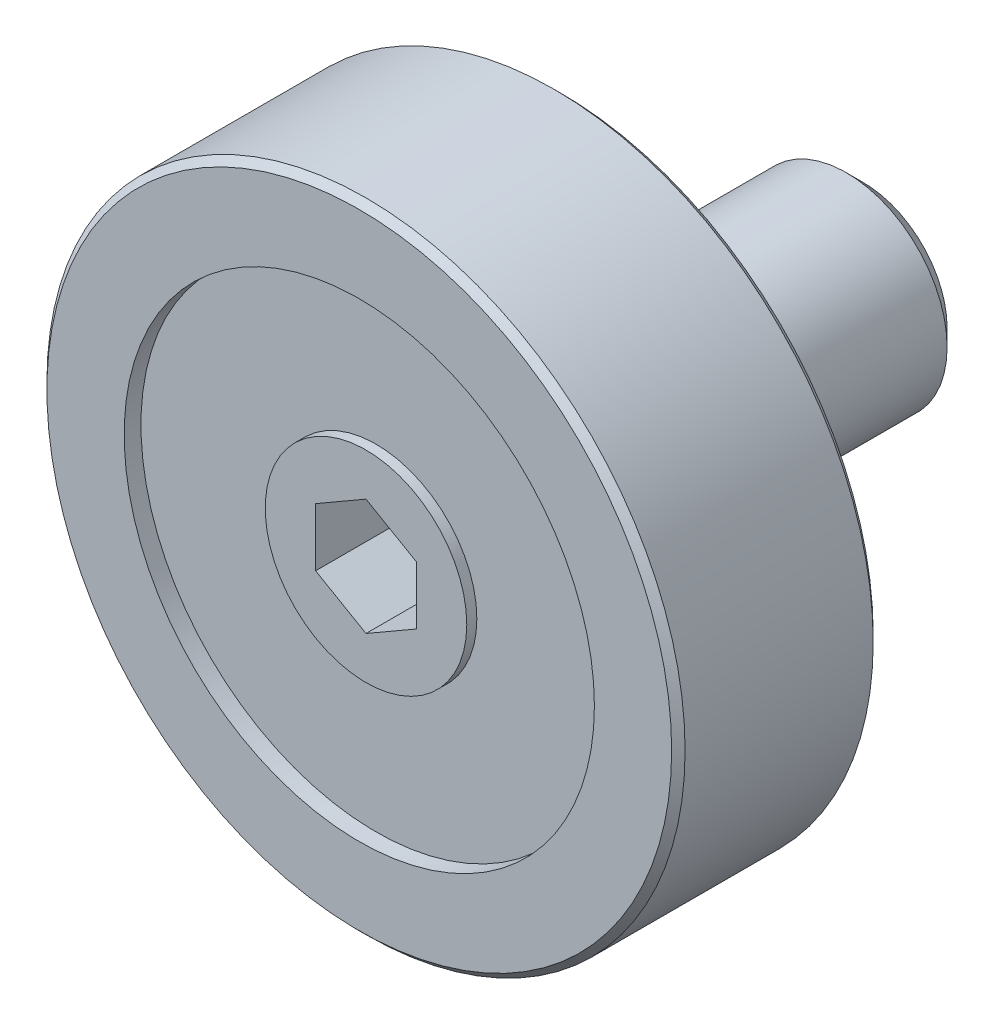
ISO-10303-21;
HEADER;
FILE_DESCRIPTION(('STEP AP214'),'2;1');
FILE_NAME('part.step','',(''),(''),'','','');
FILE_SCHEMA(('AUTOMOTIVE_DESIGN { 1 0 10303 214 1 1 1 1 }'));
ENDSEC;
DATA;
#1=APPLICATION_CONTEXT('core data for automotive mechanical design processes');
#2=APPLICATION_PROTOCOL_DEFINITION('international standard','automotive_design',2000,#1);
#3=PRODUCT_CONTEXT('',#1,'mechanical');
#4=PRODUCT('Part','Part','',(#3));
#5=PRODUCT_RELATED_PRODUCT_CATEGORY('part','',(#4));
#6=PRODUCT_DEFINITION_FORMATION('','',#4);
#7=PRODUCT_DEFINITION_CONTEXT('part definition',#1,'design');
#8=PRODUCT_DEFINITION('design','',#6,#7);
#9=PRODUCT_DEFINITION_SHAPE('','',#8);
#10=(LENGTH_UNIT() NAMED_UNIT(*) SI_UNIT(.MILLI.,.METRE.));
#11=(NAMED_UNIT(*) PLANE_ANGLE_UNIT() SI_UNIT($,.RADIAN.));
#12=(NAMED_UNIT(*) SI_UNIT($,.STERADIAN.) SOLID_ANGLE_UNIT());
#13=UNCERTAINTY_MEASURE_WITH_UNIT(LENGTH_MEASURE(1.E-05),#10,'distance_accuracy_value','');
#14=(GEOMETRIC_REPRESENTATION_CONTEXT(3) GLOBAL_UNCERTAINTY_ASSIGNED_CONTEXT((#13)) GLOBAL_UNIT_ASSIGNED_CONTEXT((#10,
#11,#12)) REPRESENTATION_CONTEXT('',''));
#15=CARTESIAN_POINT('',(0.,0.,0.));
#16=DIRECTION('',(0.,0.,1.));
#17=DIRECTION('',(1.,0.,0.));
#18=AXIS2_PLACEMENT_3D('',#15,#16,#17);
#19=CARTESIAN_POINT('',(0.,8.5,1.));
#20=DIRECTION('',(0.,0.,1.));
#21=DIRECTION('',(1.,0.,0.));
#22=AXIS2_PLACEMENT_3D('',#19,#20,#21);
#23=PLANE('',#22);
#24=CARTESIAN_POINT('',(0.,0.,1.));
#25=DIRECTION('',(0.,0.,1.));
#26=DIRECTION('',(1.,0.,0.));
#27=AXIS2_PLACEMENT_3D('',#24,#25,#26);
#28=CIRCLE('',#27,9.3);
#29=CARTESIAN_POINT('',(9.3,0.,1.));
#30=VERTEX_POINT('',#29);
#31=EDGE_CURVE('E432',#30,#30,#28,.T.);
#32=ORIENTED_EDGE('',*,*,#31,.F.);
#33=EDGE_LOOP('',(#32));
#34=FACE_BOUND('',#33,.T.);
#35=CARTESIAN_POINT('',(0.,0.,1.));
#36=DIRECTION('',(0.,0.,1.));
#37=DIRECTION('',(1.,0.,0.));
#38=AXIS2_PLACEMENT_3D('',#35,#36,#37);
#39=CIRCLE('',#38,7.);
#40=CARTESIAN_POINT('',(7.,0.,1.));
#41=VERTEX_POINT('',#40);
#42=EDGE_CURVE('E134',#41,#41,#39,.T.);
#43=ORIENTED_EDGE('',*,*,#42,.T.);
#44=EDGE_LOOP('',(#43));
#45=FACE_BOUND('',#44,.T.);
#46=ADVANCED_FACE('F14',(#34,#45),#23,.F.);
#47=CARTESIAN_POINT('',(0.,0.,-8.));
#48=DIRECTION('',(0.,0.,1.));
#49=DIRECTION('',(1.,0.,0.));
#50=AXIS2_PLACEMENT_3D('',#47,#48,#49);
#51=PLANE('',#50);
#52=CARTESIAN_POINT('',(0.,0.,-8.));
#53=DIRECTION('',(0.,0.,1.));
#54=DIRECTION('',(1.,0.,0.));
#55=AXIS2_PLACEMENT_3D('',#52,#53,#54);
#56=CIRCLE('',#55,2.49999999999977);
#57=CARTESIAN_POINT('',(2.49999999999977,0.,-8.));
#58=VERTEX_POINT('',#57);
#59=EDGE_CURVE('E9',#58,#58,#56,.T.);
#60=ORIENTED_EDGE('',*,*,#59,.F.);
#61=EDGE_LOOP('',(#60));
#62=FACE_BOUND('',#61,.T.);
#63=ADVANCED_FACE('F16',(#62),#51,.F.);
#64=CARTESIAN_POINT('',(0.,0.,-8.));
#65=DIRECTION('',(0.,0.,1.));
#66=DIRECTION('',(1.,0.,0.));
#67=AXIS2_PLACEMENT_3D('',#64,#65,#66);
#68=CONICAL_SURFACE('',#67,2.49999999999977,0.785398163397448);
#69=CARTESIAN_POINT('',(0.,0.,-7.5));
#70=DIRECTION('',(0.,0.,1.));
#71=DIRECTION('',(1.,0.,0.));
#72=AXIS2_PLACEMENT_3D('',#69,#70,#71);
#73=CIRCLE('',#72,2.99999999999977);
#74=CARTESIAN_POINT('',(2.99999999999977,0.,-7.5));
#75=VERTEX_POINT('',#74);
#76=EDGE_CURVE('E22',#75,#75,#73,.T.);
#77=ORIENTED_EDGE('',*,*,#76,.F.);
#78=EDGE_LOOP('',(#77));
#79=FACE_BOUND('',#78,.T.);
#80=ORIENTED_EDGE('',*,*,#59,.T.);
#81=EDGE_LOOP('',(#80));
#82=FACE_BOUND('',#81,.T.);
#83=ADVANCED_FACE('F159',(#79,#82),#68,.T.);
#84=CARTESIAN_POINT('',(0.,0.,10.));
#85=DIRECTION('',(0.,0.,1.));
#86=DIRECTION('',(1.,0.,0.));
#87=AXIS2_PLACEMENT_3D('',#84,#85,#86);
#88=CYLINDRICAL_SURFACE('',#87,2.99999999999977);
#89=CARTESIAN_POINT('',(0.,0.,-2.));
#90=DIRECTION('',(0.,0.,1.));
#91=DIRECTION('',(1.,0.,0.));
#92=AXIS2_PLACEMENT_3D('',#89,#90,#91);
#93=CIRCLE('',#92,2.99999999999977);
#94=CARTESIAN_POINT('',(2.99999999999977,0.,-2.));
#95=VERTEX_POINT('',#94);
#96=EDGE_CURVE('E152',#95,#95,#93,.T.);
#97=ORIENTED_EDGE('',*,*,#96,.F.);
#98=EDGE_LOOP('',(#97));
#99=FACE_BOUND('',#98,.T.);
#100=ORIENTED_EDGE('',*,*,#76,.T.);
#101=EDGE_LOOP('',(#100));
#102=FACE_BOUND('',#101,.T.);
#103=ADVANCED_FACE('F157',(#99,#102),#88,.T.);
#104=CARTESIAN_POINT('',(0.,2.34999999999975,-2.));
#105=DIRECTION('',(0.,0.,-1.));
#106=DIRECTION('',(-1.,0.,0.));
#107=AXIS2_PLACEMENT_3D('',#104,#105,#106);
#108=PLANE('',#107);
#109=CARTESIAN_POINT('',(0.,0.,-2.));
#110=DIRECTION('',(0.,0.,1.));
#111=DIRECTION('',(1.,0.,0.));
#112=AXIS2_PLACEMENT_3D('',#109,#110,#111);
#113=CIRCLE('',#112,2.34999999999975);
#114=CARTESIAN_POINT('',(2.34999999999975,0.,-2.));
#115=VERTEX_POINT('',#114);
#116=EDGE_CURVE('E149',#115,#115,#113,.T.);
#117=ORIENTED_EDGE('',*,*,#116,.F.);
#118=EDGE_LOOP('',(#117));
#119=FACE_BOUND('',#118,.T.);
#120=ORIENTED_EDGE('',*,*,#96,.T.);
#121=EDGE_LOOP('',(#120));
#122=FACE_BOUND('',#121,.T.);
#123=ADVANCED_FACE('F199',(#119,#122),#108,.F.);
#124=CARTESIAN_POINT('',(0.,0.,10.));
#125=DIRECTION('',(0.,0.,1.));
#126=DIRECTION('',(1.,0.,0.));
#127=AXIS2_PLACEMENT_3D('',#124,#125,#126);
#128=CYLINDRICAL_SURFACE('',#127,2.34999999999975);
#129=CARTESIAN_POINT('',(0.,0.,0.));
#130=DIRECTION('',(0.,0.,1.));
#131=DIRECTION('',(1.,0.,0.));
#132=AXIS2_PLACEMENT_3D('',#129,#130,#131);
#133=CIRCLE('',#132,2.34999999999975);
#134=CARTESIAN_POINT('',(2.34999999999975,0.,0.));
#135=VERTEX_POINT('',#134);
#136=EDGE_CURVE('E146',#135,#135,#133,.T.);
#137=ORIENTED_EDGE('',*,*,#136,.F.);
#138=EDGE_LOOP('',(#137));
#139=FACE_BOUND('',#138,.T.);
#140=ORIENTED_EDGE('',*,*,#116,.T.);
#141=EDGE_LOOP('',(#140));
#142=FACE_BOUND('',#141,.T.);
#143=ADVANCED_FACE('F195',(#139,#142),#128,.T.);
#144=CARTESIAN_POINT('',(0.,3.99999999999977,0.));
#145=DIRECTION('',(0.,0.,1.));
#146=DIRECTION('',(1.,0.,0.));
#147=AXIS2_PLACEMENT_3D('',#144,#145,#146);
#148=PLANE('',#147);
#149=CARTESIAN_POINT('',(0.,0.,0.));
#150=DIRECTION('',(0.,0.,1.));
#151=DIRECTION('',(1.,0.,0.));
#152=AXIS2_PLACEMENT_3D('',#149,#150,#151);
#153=CIRCLE('',#152,3.99999999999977);
#154=CARTESIAN_POINT('',(3.99999999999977,0.,0.));
#155=VERTEX_POINT('',#154);
#156=EDGE_CURVE('E143',#155,#155,#153,.T.);
#157=ORIENTED_EDGE('',*,*,#156,.F.);
#158=EDGE_LOOP('',(#157));
#159=FACE_BOUND('',#158,.T.);
#160=ORIENTED_EDGE('',*,*,#136,.T.);
#161=EDGE_LOOP('',(#160));
#162=FACE_BOUND('',#161,.T.);
#163=ADVANCED_FACE('F191',(#159,#162),#148,.F.);
#164=CARTESIAN_POINT('',(0.,0.,10.));
#165=DIRECTION('',(0.,0.,1.));
#166=DIRECTION('',(1.,0.,0.));
#167=AXIS2_PLACEMENT_3D('',#164,#165,#166);
#168=CYLINDRICAL_SURFACE('',#167,3.99999999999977);
#169=CARTESIAN_POINT('',(0.,0.,1.5));
#170=DIRECTION('',(0.,0.,1.));
#171=DIRECTION('',(1.,0.,0.));
#172=AXIS2_PLACEMENT_3D('',#169,#170,#171);
#173=CIRCLE('',#172,3.99999999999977);
#174=CARTESIAN_POINT('',(3.99999999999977,0.,1.5));
#175=VERTEX_POINT('',#174);
#176=EDGE_CURVE('E140',#175,#175,#173,.T.);
#177=ORIENTED_EDGE('',*,*,#176,.F.);
#178=EDGE_LOOP('',(#177));
#179=FACE_BOUND('',#178,.T.);
#180=ORIENTED_EDGE('',*,*,#156,.T.);
#181=EDGE_LOOP('',(#180));
#182=FACE_BOUND('',#181,.T.);
#183=ADVANCED_FACE('F187',(#179,#182),#168,.T.);
#184=CARTESIAN_POINT('',(0.,3.99999999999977,1.5));
#185=DIRECTION('',(0.,0.,1.));
#186=DIRECTION('',(1.,0.,0.));
#187=AXIS2_PLACEMENT_3D('',#184,#185,#186);
#188=PLANE('',#187);
#189=CARTESIAN_POINT('',(0.,0.,1.5));
#190=DIRECTION('',(0.,0.,1.));
#191=DIRECTION('',(1.,0.,0.));
#192=AXIS2_PLACEMENT_3D('',#189,#190,#191);
#193=CIRCLE('',#192,7.);
#194=CARTESIAN_POINT('',(7.,0.,1.5));
#195=VERTEX_POINT('',#194);
#196=EDGE_CURVE('E137',#195,#195,#193,.T.);
#197=ORIENTED_EDGE('',*,*,#196,.F.);
#198=EDGE_LOOP('',(#197));
#199=FACE_BOUND('',#198,.T.);
#200=ORIENTED_EDGE('',*,*,#176,.T.);
#201=EDGE_LOOP('',(#200));
#202=FACE_BOUND('',#201,.T.);
#203=ADVANCED_FACE('F183',(#199,#202),#188,.F.);
#204=CARTESIAN_POINT('',(0.,0.,10.));
#205=DIRECTION('',(0.,0.,1.));
#206=DIRECTION('',(1.,0.,0.));
#207=AXIS2_PLACEMENT_3D('',#204,#205,#206);
#208=CYLINDRICAL_SURFACE('',#207,7.);
#209=ORIENTED_EDGE('',*,*,#42,.F.);
#210=EDGE_LOOP('',(#209));
#211=FACE_BOUND('',#210,.T.);
#212=ORIENTED_EDGE('',*,*,#196,.T.);
#213=EDGE_LOOP('',(#212));
#214=FACE_BOUND('',#213,.T.);
#215=ADVANCED_FACE('F179',(#211,#214),#208,.F.);
#216=CARTESIAN_POINT('',(0.,0.,6.8));
#217=DIRECTION('',(0.,0.,-1.));
#218=DIRECTION('',(-1.,0.,0.));
#219=AXIS2_PLACEMENT_3D('',#216,#217,#218);
#220=CONICAL_SURFACE('',#219,9.5,0.78539816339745);
#221=CARTESIAN_POINT('',(0.,0.,7.));
#222=DIRECTION('',(0.,0.,1.));
#223=DIRECTION('',(1.,0.,0.));
#224=AXIS2_PLACEMENT_3D('',#221,#222,#223);
#225=CIRCLE('',#224,9.3);
#226=CARTESIAN_POINT('',(9.3,0.,7.));
#227=VERTEX_POINT('',#226);
#228=EDGE_CURVE('E104',#227,#227,#225,.T.);
#229=ORIENTED_EDGE('',*,*,#228,.F.);
#230=EDGE_LOOP('',(#229));
#231=FACE_BOUND('',#230,.T.);
#232=CARTESIAN_POINT('',(0.,0.,6.8));
#233=DIRECTION('',(0.,0.,1.));
#234=DIRECTION('',(1.,0.,0.));
#235=AXIS2_PLACEMENT_3D('',#232,#233,#234);
#236=CIRCLE('',#235,9.5);
#237=CARTESIAN_POINT('',(9.5,0.,6.8));
#238=VERTEX_POINT('',#237);
#239=EDGE_CURVE('E413',#238,#238,#236,.T.);
#240=ORIENTED_EDGE('',*,*,#239,.T.);
#241=EDGE_LOOP('',(#240));
#242=FACE_BOUND('',#241,.T.);
#243=ADVANCED_FACE('F182',(#231,#242),#220,.T.);
#244=CARTESIAN_POINT('',(0.,0.,7.));
#245=DIRECTION('',(0.,0.,1.));
#246=DIRECTION('',(1.,0.,0.));
#247=AXIS2_PLACEMENT_3D('',#244,#245,#246);
#248=CYLINDRICAL_SURFACE('',#247,9.5);
#249=ORIENTED_EDGE('',*,*,#239,.F.);
#250=EDGE_LOOP('',(#249));
#251=FACE_BOUND('',#250,.T.);
#252=CARTESIAN_POINT('',(0.,0.,1.2));
#253=DIRECTION('',(0.,0.,1.));
#254=DIRECTION('',(1.,0.,0.));
#255=AXIS2_PLACEMENT_3D('',#252,#253,#254);
#256=CIRCLE('',#255,9.5);
#257=CARTESIAN_POINT('',(9.5,0.,1.2));
#258=VERTEX_POINT('',#257);
#259=EDGE_CURVE('E416',#258,#258,#256,.T.);
#260=ORIENTED_EDGE('',*,*,#259,.T.);
#261=EDGE_LOOP('',(#260));
#262=FACE_BOUND('',#261,.T.);
#263=ADVANCED_FACE('F251',(#251,#262),#248,.T.);
#264=CARTESIAN_POINT('',(0.,0.,1.));
#265=DIRECTION('',(0.,0.,1.));
#266=DIRECTION('',(1.,0.,0.));
#267=AXIS2_PLACEMENT_3D('',#264,#265,#266);
#268=CONICAL_SURFACE('',#267,9.3,0.78539816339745);
#269=ORIENTED_EDGE('',*,*,#259,.F.);
#270=EDGE_LOOP('',(#269));
#271=FACE_BOUND('',#270,.T.);
#272=ORIENTED_EDGE('',*,*,#31,.T.);
#273=EDGE_LOOP('',(#272));
#274=FACE_BOUND('',#273,.T.);
#275=ADVANCED_FACE('F260',(#271,#274),#268,.T.);
#276=CARTESIAN_POINT('',(0.,0.,4.3));
#277=DIRECTION('',(0.,0.,1.));
#278=DIRECTION('',(1.,0.,0.));
#279=AXIS2_PLACEMENT_3D('',#276,#277,#278);
#280=PLANE('',#279);
#281=DIRECTION('',(-0.866025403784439,0.5,0.));
#282=VECTOR('',#281,1.);
#283=CARTESIAN_POINT('',(1.5,0.86602540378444,4.3));
#284=LINE('',#283,#282);
#285=CARTESIAN_POINT('',(1.5,0.86602540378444,4.3));
#286=VERTEX_POINT('',#285);
#287=CARTESIAN_POINT('',(0.,1.73205080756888,4.3));
#288=VERTEX_POINT('',#287);
#289=EDGE_CURVE('E115',#286,#288,#284,.T.);
#290=ORIENTED_EDGE('',*,*,#289,.T.);
#291=DIRECTION('',(-0.866025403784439,-0.5,0.));
#292=VECTOR('',#291,1.);
#293=CARTESIAN_POINT('',(0.,1.73205080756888,4.3));
#294=LINE('',#293,#292);
#295=CARTESIAN_POINT('',(-1.5,0.866025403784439,4.3));
#296=VERTEX_POINT('',#295);
#297=EDGE_CURVE('E97',#288,#296,#294,.T.);
#298=ORIENTED_EDGE('',*,*,#297,.T.);
#299=DIRECTION('',(0.,-1.,0.));
#300=VECTOR('',#299,1.);
#301=CARTESIAN_POINT('',(-1.5,0.866025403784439,4.3));
#302=LINE('',#301,#300);
#303=CARTESIAN_POINT('',(-1.5,-0.866025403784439,4.3));
#304=VERTEX_POINT('',#303);
#305=EDGE_CURVE('E95',#296,#304,#302,.T.);
#306=ORIENTED_EDGE('',*,*,#305,.T.);
#307=DIRECTION('',(0.866025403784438,-0.5,0.));
#308=VECTOR('',#307,1.);
#309=CARTESIAN_POINT('',(-1.5,-0.866025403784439,4.3));
#310=LINE('',#309,#308);
#311=CARTESIAN_POINT('',(0.,-1.73205080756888,4.3));
#312=VERTEX_POINT('',#311);
#313=EDGE_CURVE('E74',#304,#312,#310,.T.);
#314=ORIENTED_EDGE('',*,*,#313,.T.);
#315=DIRECTION('',(0.866025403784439,0.5,0.));
#316=VECTOR('',#315,1.);
#317=CARTESIAN_POINT('',(0.,-1.73205080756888,4.3));
#318=LINE('',#317,#316);
#319=CARTESIAN_POINT('',(1.5,-0.866025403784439,4.3));
#320=VERTEX_POINT('',#319);
#321=EDGE_CURVE('E85',#312,#320,#318,.T.);
#322=ORIENTED_EDGE('',*,*,#321,.T.);
#323=DIRECTION('',(0.,1.,0.));
#324=VECTOR('',#323,1.);
#325=CARTESIAN_POINT('',(1.5,-0.866025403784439,4.3));
#326=LINE('',#325,#324);
#327=EDGE_CURVE('E89',#320,#286,#326,.T.);
#328=ORIENTED_EDGE('',*,*,#327,.T.);
#329=EDGE_LOOP('',(#290,#298,#306,#314,#322,#328));
#330=FACE_BOUND('',#329,.T.);
#331=ADVANCED_FACE('F92',(#330),#280,.T.);
#332=CARTESIAN_POINT('',(-1.5,0.866025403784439,4.3));
#333=DIRECTION('',(-1.,0.,0.));
#334=DIRECTION('',(0.,-1.,0.));
#335=AXIS2_PLACEMENT_3D('',#332,#333,#334);
#336=PLANE('',#335);
#337=DIRECTION('',(0.,-1.,0.));
#338=VECTOR('',#337,1.);
#339=CARTESIAN_POINT('',(-1.5,0.866025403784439,6.8));
#340=LINE('',#339,#338);
#341=CARTESIAN_POINT('',(-1.5,0.866025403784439,6.8));
#342=VERTEX_POINT('',#341);
#343=CARTESIAN_POINT('',(-1.5,-0.866025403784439,6.8));
#344=VERTEX_POINT('',#343);
#345=EDGE_CURVE('E107',#342,#344,#340,.T.);
#346=ORIENTED_EDGE('',*,*,#345,.T.);
#347=DIRECTION('',(0.,0.,1.));
#348=VECTOR('',#347,1.);
#349=CARTESIAN_POINT('',(-1.5,-0.866025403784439,4.3));
#350=LINE('',#349,#348);
#351=EDGE_CURVE('E82',#304,#344,#350,.T.);
#352=ORIENTED_EDGE('',*,*,#351,.F.);
#353=ORIENTED_EDGE('',*,*,#305,.F.);
#354=DIRECTION('',(0.,0.,1.));
#355=VECTOR('',#354,1.);
#356=CARTESIAN_POINT('',(-1.5,0.866025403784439,4.3));
#357=LINE('',#356,#355);
#358=EDGE_CURVE('E120',#296,#342,#357,.T.);
#359=ORIENTED_EDGE('',*,*,#358,.T.);
#360=EDGE_LOOP('',(#346,#352,#353,#359));
#361=FACE_BOUND('',#360,.T.);
#362=ADVANCED_FACE('F277',(#361),#336,.F.);
#363=CARTESIAN_POINT('',(-1.5,-0.866025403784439,4.3));
#364=DIRECTION('',(-0.5,-0.866025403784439,0.));
#365=DIRECTION('',(0.866025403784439,-0.5,0.));
#366=AXIS2_PLACEMENT_3D('',#363,#364,#365);
#367=PLANE('',#366);
#368=DIRECTION('',(0.866025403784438,-0.5,0.));
#369=VECTOR('',#368,1.);
#370=CARTESIAN_POINT('',(-1.5,-0.866025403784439,6.8));
#371=LINE('',#370,#369);
#372=CARTESIAN_POINT('',(0.,-1.73205080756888,6.8));
#373=VERTEX_POINT('',#372);
#374=EDGE_CURVE('E77',#344,#373,#371,.T.);
#375=ORIENTED_EDGE('',*,*,#374,.T.);
#376=DIRECTION('',(0.,0.,1.));
#377=VECTOR('',#376,1.);
#378=CARTESIAN_POINT('',(0.,-1.73205080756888,4.3));
#379=LINE('',#378,#377);
#380=EDGE_CURVE('E70',#312,#373,#379,.T.);
#381=ORIENTED_EDGE('',*,*,#380,.F.);
#382=ORIENTED_EDGE('',*,*,#313,.F.);
#383=ORIENTED_EDGE('',*,*,#351,.T.);
#384=EDGE_LOOP('',(#375,#381,#382,#383));
#385=FACE_BOUND('',#384,.T.);
#386=ADVANCED_FACE('F72',(#385),#367,.F.);
#387=CARTESIAN_POINT('',(0.,-1.73205080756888,4.3));
#388=DIRECTION('',(0.5,-0.866025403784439,0.));
#389=DIRECTION('',(0.866025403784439,0.5,0.));
#390=AXIS2_PLACEMENT_3D('',#387,#388,#389);
#391=PLANE('',#390);
#392=DIRECTION('',(0.866025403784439,0.5,0.));
#393=VECTOR('',#392,1.);
#394=CARTESIAN_POINT('',(0.,-1.73205080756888,6.8));
#395=LINE('',#394,#393);
#396=CARTESIAN_POINT('',(1.5,-0.866025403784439,6.8));
#397=VERTEX_POINT('',#396);
#398=EDGE_CURVE('E111',#373,#397,#395,.T.);
#399=ORIENTED_EDGE('',*,*,#398,.T.);
#400=DIRECTION('',(0.,0.,1.));
#401=VECTOR('',#400,1.);
#402=CARTESIAN_POINT('',(1.5,-0.866025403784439,4.3));
#403=LINE('',#402,#401);
#404=EDGE_CURVE('E81',#320,#397,#403,.T.);
#405=ORIENTED_EDGE('',*,*,#404,.F.);
#406=ORIENTED_EDGE('',*,*,#321,.F.);
#407=ORIENTED_EDGE('',*,*,#380,.T.);
#408=EDGE_LOOP('',(#399,#405,#406,#407));
#409=FACE_BOUND('',#408,.T.);
#410=ADVANCED_FACE('F86',(#409),#391,.F.);
#411=CARTESIAN_POINT('',(1.5,-0.866025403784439,4.3));
#412=DIRECTION('',(1.,0.,0.));
#413=DIRECTION('',(0.,0.,-1.));
#414=AXIS2_PLACEMENT_3D('',#411,#412,#413);
#415=PLANE('',#414);
#416=DIRECTION('',(0.,1.,0.));
#417=VECTOR('',#416,1.);
#418=CARTESIAN_POINT('',(1.5,-0.866025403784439,6.8));
#419=LINE('',#418,#417);
#420=CARTESIAN_POINT('',(1.5,0.86602540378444,6.8));
#421=VERTEX_POINT('',#420);
#422=EDGE_CURVE('E113',#397,#421,#419,.T.);
#423=ORIENTED_EDGE('',*,*,#422,.T.);
#424=DIRECTION('',(0.,0.,1.));
#425=VECTOR('',#424,1.);
#426=CARTESIAN_POINT('',(1.5,0.86602540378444,4.3));
#427=LINE('',#426,#425);
#428=EDGE_CURVE('E37',#286,#421,#427,.T.);
#429=ORIENTED_EDGE('',*,*,#428,.F.);
#430=ORIENTED_EDGE('',*,*,#327,.F.);
#431=ORIENTED_EDGE('',*,*,#404,.T.);
#432=EDGE_LOOP('',(#423,#429,#430,#431));
#433=FACE_BOUND('',#432,.T.);
#434=ADVANCED_FACE('F300',(#433),#415,.F.);
#435=CARTESIAN_POINT('',(1.5,0.86602540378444,4.3));
#436=DIRECTION('',(0.5,0.866025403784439,0.));
#437=DIRECTION('',(-0.866025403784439,0.5,0.));
#438=AXIS2_PLACEMENT_3D('',#435,#436,#437);
#439=PLANE('',#438);
#440=DIRECTION('',(-0.866025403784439,0.5,0.));
#441=VECTOR('',#440,1.);
#442=CARTESIAN_POINT('',(1.5,0.86602540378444,6.8));
#443=LINE('',#442,#441);
#444=CARTESIAN_POINT('',(0.,1.73205080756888,6.8));
#445=VERTEX_POINT('',#444);
#446=EDGE_CURVE('E29',#421,#445,#443,.T.);
#447=ORIENTED_EDGE('',*,*,#446,.T.);
#448=DIRECTION('',(0.,0.,1.));
#449=VECTOR('',#448,1.);
#450=CARTESIAN_POINT('',(0.,1.73205080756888,4.3));
#451=LINE('',#450,#449);
#452=EDGE_CURVE('E59',#288,#445,#451,.T.);
#453=ORIENTED_EDGE('',*,*,#452,.F.);
#454=ORIENTED_EDGE('',*,*,#289,.F.);
#455=ORIENTED_EDGE('',*,*,#428,.T.);
#456=EDGE_LOOP('',(#447,#453,#454,#455));
#457=FACE_BOUND('',#456,.T.);
#458=ADVANCED_FACE('F308',(#457),#439,.F.);
#459=CARTESIAN_POINT('',(0.,1.73205080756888,4.3));
#460=DIRECTION('',(-0.5,0.866025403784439,0.));
#461=DIRECTION('',(-0.866025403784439,-0.5,0.));
#462=AXIS2_PLACEMENT_3D('',#459,#460,#461);
#463=PLANE('',#462);
#464=DIRECTION('',(-0.866025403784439,-0.5,0.));
#465=VECTOR('',#464,1.);
#466=CARTESIAN_POINT('',(0.,1.73205080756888,6.8));
#467=LINE('',#466,#465);
#468=EDGE_CURVE('E103',#445,#342,#467,.T.);
#469=ORIENTED_EDGE('',*,*,#468,.T.);
#470=ORIENTED_EDGE('',*,*,#358,.F.);
#471=ORIENTED_EDGE('',*,*,#297,.F.);
#472=ORIENTED_EDGE('',*,*,#452,.T.);
#473=EDGE_LOOP('',(#469,#470,#471,#472));
#474=FACE_BOUND('',#473,.T.);
#475=ADVANCED_FACE('F316',(#474),#463,.F.);
#476=CARTESIAN_POINT('',(0.,3.,6.8));
#477=DIRECTION('',(0.,0.,-1.));
#478=DIRECTION('',(-1.,0.,0.));
#479=AXIS2_PLACEMENT_3D('',#476,#477,#478);
#480=PLANE('',#479);
#481=ORIENTED_EDGE('',*,*,#468,.F.);
#482=ORIENTED_EDGE('',*,*,#446,.F.);
#483=ORIENTED_EDGE('',*,*,#422,.F.);
#484=ORIENTED_EDGE('',*,*,#398,.F.);
#485=ORIENTED_EDGE('',*,*,#374,.F.);
#486=ORIENTED_EDGE('',*,*,#345,.F.);
#487=EDGE_LOOP('',(#481,#482,#483,#484,#485,#486));
#488=FACE_BOUND('',#487,.T.);
#489=CARTESIAN_POINT('',(0.,0.,6.8));
#490=DIRECTION('',(0.,0.,1.));
#491=DIRECTION('',(1.,0.,0.));
#492=AXIS2_PLACEMENT_3D('',#489,#490,#491);
#493=CIRCLE('',#492,3.);
#494=CARTESIAN_POINT('',(3.,0.,6.8));
#495=VERTEX_POINT('',#494);
#496=EDGE_CURVE('E117',#495,#495,#493,.T.);
#497=ORIENTED_EDGE('',*,*,#496,.T.);
#498=EDGE_LOOP('',(#497));
#499=FACE_BOUND('',#498,.T.);
#500=ADVANCED_FACE('F324',(#488,#499),#480,.F.);
#501=CARTESIAN_POINT('',(0.,0.,10.));
#502=DIRECTION('',(0.,0.,1.));
#503=DIRECTION('',(1.,0.,0.));
#504=AXIS2_PLACEMENT_3D('',#501,#502,#503);
#505=CYLINDRICAL_SURFACE('',#504,3.);
#506=ORIENTED_EDGE('',*,*,#496,.F.);
#507=EDGE_LOOP('',(#506));
#508=FACE_BOUND('',#507,.T.);
#509=CARTESIAN_POINT('',(0.,0.,6.5));
#510=DIRECTION('',(0.,0.,1.));
#511=DIRECTION('',(1.,0.,0.));
#512=AXIS2_PLACEMENT_3D('',#509,#510,#511);
#513=CIRCLE('',#512,3.);
#514=CARTESIAN_POINT('',(3.,0.,6.5));
#515=VERTEX_POINT('',#514);
#516=EDGE_CURVE('E125',#515,#515,#513,.T.);
#517=ORIENTED_EDGE('',*,*,#516,.T.);
#518=EDGE_LOOP('',(#517));
#519=FACE_BOUND('',#518,.T.);
#520=ADVANCED_FACE('F333',(#508,#519),#505,.T.);
#521=CARTESIAN_POINT('',(0.,3.,6.5));
#522=DIRECTION('',(0.,0.,-1.));
#523=DIRECTION('',(-1.,0.,0.));
#524=AXIS2_PLACEMENT_3D('',#521,#522,#523);
#525=PLANE('',#524);
#526=ORIENTED_EDGE('',*,*,#516,.F.);
#527=EDGE_LOOP('',(#526));
#528=FACE_BOUND('',#527,.T.);
#529=CARTESIAN_POINT('',(0.,0.,6.5));
#530=DIRECTION('',(0.,0.,1.));
#531=DIRECTION('',(1.,0.,0.));
#532=AXIS2_PLACEMENT_3D('',#529,#530,#531);
#533=CIRCLE('',#532,7.);
#534=CARTESIAN_POINT('',(7.,0.,6.5));
#535=VERTEX_POINT('',#534);
#536=EDGE_CURVE('E128',#535,#535,#533,.T.);
#537=ORIENTED_EDGE('',*,*,#536,.T.);
#538=EDGE_LOOP('',(#537));
#539=FACE_BOUND('',#538,.T.);
#540=ADVANCED_FACE('F342',(#528,#539),#525,.F.);
#541=CARTESIAN_POINT('',(0.,0.,10.));
#542=DIRECTION('',(0.,0.,1.));
#543=DIRECTION('',(1.,0.,0.));
#544=AXIS2_PLACEMENT_3D('',#541,#542,#543);
#545=CYLINDRICAL_SURFACE('',#544,7.);
#546=ORIENTED_EDGE('',*,*,#536,.F.);
#547=EDGE_LOOP('',(#546));
#548=FACE_BOUND('',#547,.T.);
#549=CARTESIAN_POINT('',(0.,0.,7.));
#550=DIRECTION('',(0.,0.,1.));
#551=DIRECTION('',(1.,0.,0.));
#552=AXIS2_PLACEMENT_3D('',#549,#550,#551);
#553=CIRCLE('',#552,7.);
#554=CARTESIAN_POINT('',(7.,0.,7.));
#555=VERTEX_POINT('',#554);
#556=EDGE_CURVE('E131',#555,#555,#553,.T.);
#557=ORIENTED_EDGE('',*,*,#556,.T.);
#558=EDGE_LOOP('',(#557));
#559=FACE_BOUND('',#558,.T.);
#560=ADVANCED_FACE('F351',(#548,#559),#545,.F.);
#561=CARTESIAN_POINT('',(0.,8.5,7.));
#562=DIRECTION('',(0.,0.,-1.));
#563=DIRECTION('',(-1.,0.,0.));
#564=AXIS2_PLACEMENT_3D('',#561,#562,#563);
#565=PLANE('',#564);
#566=ORIENTED_EDGE('',*,*,#556,.F.);
#567=EDGE_LOOP('',(#566));
#568=FACE_BOUND('',#567,.T.);
#569=ORIENTED_EDGE('',*,*,#228,.T.);
#570=EDGE_LOOP('',(#569));
#571=FACE_BOUND('',#570,.T.);
#572=ADVANCED_FACE('F177',(#568,#571),#565,.F.);
#573=CLOSED_SHELL('',(#46,#63,#83,#103,#123,#143,#163,#183,#203,#215,#243,#263,#275,#331,#362,
#386,#410,#434,#458,#475,#500,#520,#540,#560,#572));
#574=MANIFOLD_SOLID_BREP('B1',#573);
#575=ADVANCED_BREP_SHAPE_REPRESENTATION('',(#18,#574),#14);
#576=SHAPE_DEFINITION_REPRESENTATION(#9,#575);
ENDSEC;
END-ISO-10303-21;
